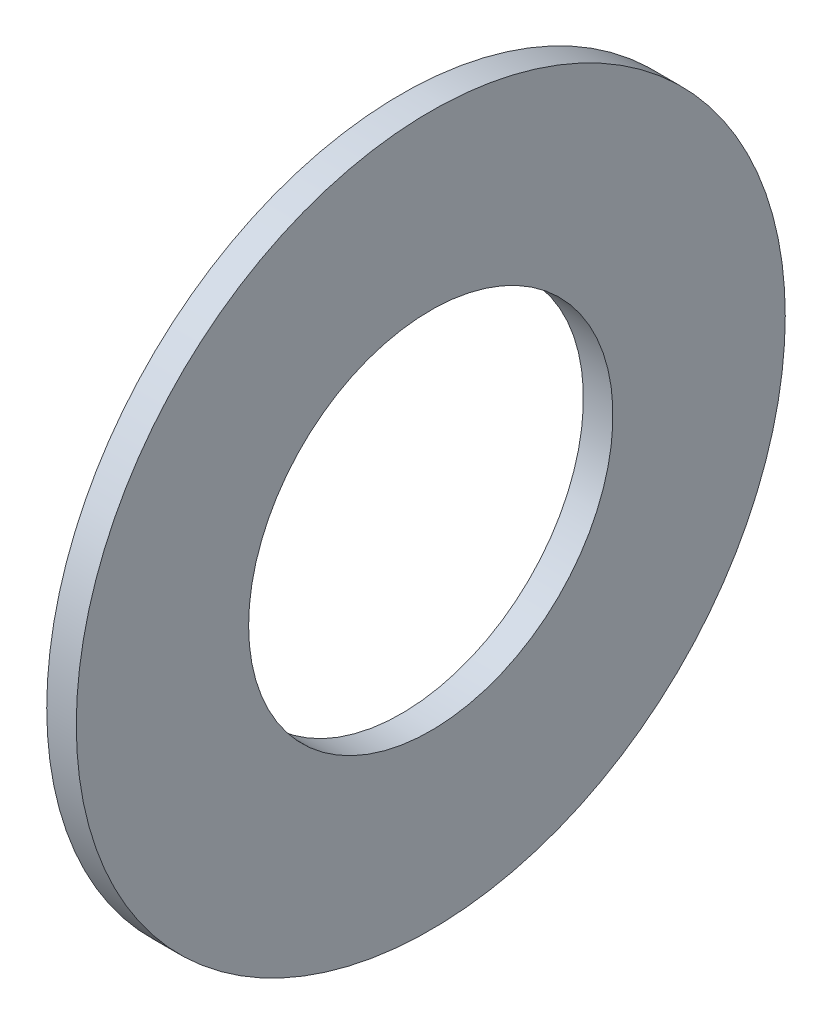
from build123d import *

# Parameters (mm, degrees)
SKETCH1_W = 3
SKETCH1_H = 17.5


with BuildPart() as part:
    # Sketch1 → Base-Revolve (revolve)
    with BuildSketch(Plane.XY, mode=Mode.PRIVATE) as base_revolve_sk:
        with Locations((-1.5, 27.25)):
            Rectangle(SKETCH1_W, SKETCH1_H)
    revolve(base_revolve_sk.sketch.rotate(Axis((-34.925, 0, 0), (1, 0, 0)), 90), axis=Axis((-34.925, 0, 0), (1, 0, 0)))


solid = part.part
